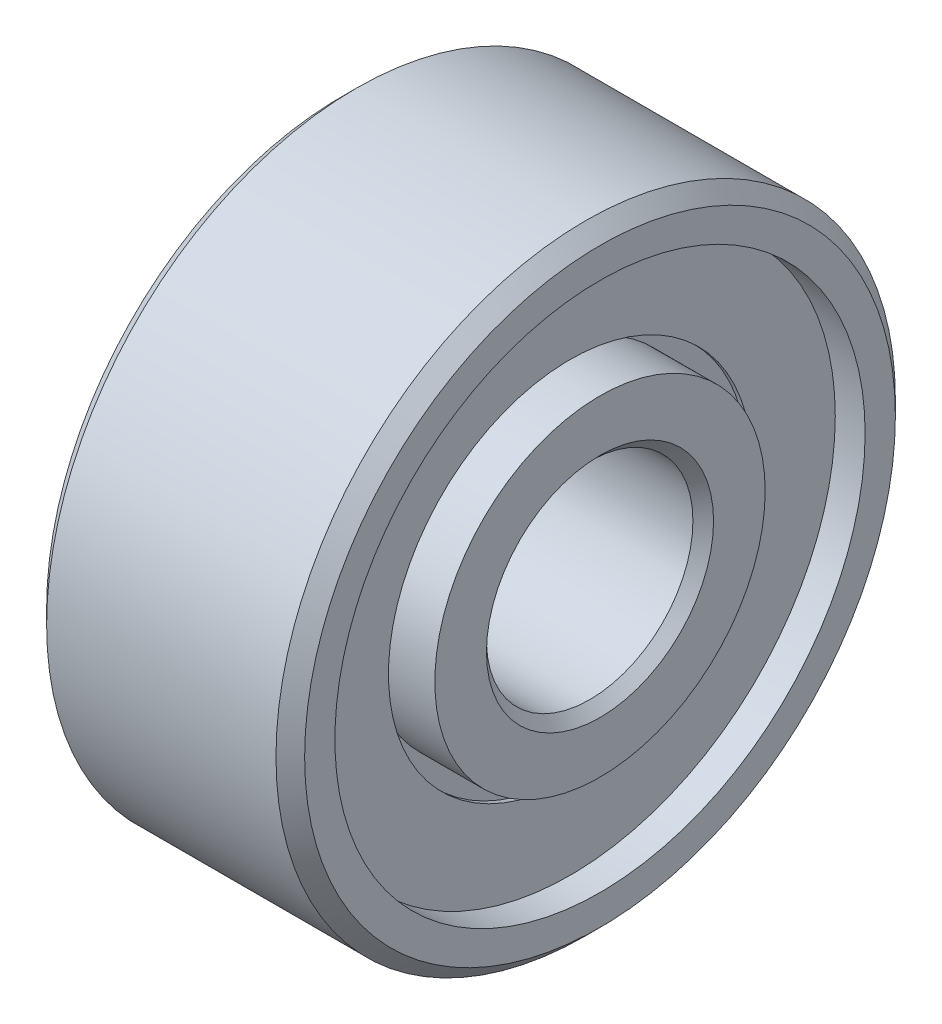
ISO-10303-21;
HEADER;
FILE_DESCRIPTION(('STEP AP214'),'2;1');
FILE_NAME('part.step','',(''),(''),'','','');
FILE_SCHEMA(('AUTOMOTIVE_DESIGN { 1 0 10303 214 1 1 1 1 }'));
ENDSEC;
DATA;
#1=APPLICATION_CONTEXT('core data for automotive mechanical design processes');
#2=APPLICATION_PROTOCOL_DEFINITION('international standard','automotive_design',2000,#1);
#3=PRODUCT_CONTEXT('',#1,'mechanical');
#4=PRODUCT('Part','Part','',(#3));
#5=PRODUCT_RELATED_PRODUCT_CATEGORY('part','',(#4));
#6=PRODUCT_DEFINITION_FORMATION('','',#4);
#7=PRODUCT_DEFINITION_CONTEXT('part definition',#1,'design');
#8=PRODUCT_DEFINITION('design','',#6,#7);
#9=PRODUCT_DEFINITION_SHAPE('','',#8);
#10=(LENGTH_UNIT() NAMED_UNIT(*) SI_UNIT(.MILLI.,.METRE.));
#11=(NAMED_UNIT(*) PLANE_ANGLE_UNIT() SI_UNIT($,.RADIAN.));
#12=(NAMED_UNIT(*) SI_UNIT($,.STERADIAN.) SOLID_ANGLE_UNIT());
#13=UNCERTAINTY_MEASURE_WITH_UNIT(LENGTH_MEASURE(1.E-05),#10,'distance_accuracy_value','');
#14=(GEOMETRIC_REPRESENTATION_CONTEXT(3) GLOBAL_UNCERTAINTY_ASSIGNED_CONTEXT((#13)) GLOBAL_UNIT_ASSIGNED_CONTEXT((#10,
#11,#12)) REPRESENTATION_CONTEXT('',''));
#15=CARTESIAN_POINT('',(0.,0.,0.));
#16=DIRECTION('',(0.,0.,1.));
#17=DIRECTION('',(1.,0.,0.));
#18=AXIS2_PLACEMENT_3D('',#15,#16,#17);
#19=CARTESIAN_POINT('',(-2.182114,0.,0.));
#20=DIRECTION('',(1.,0.,0.));
#21=DIRECTION('',(0.,0.,-1.));
#22=AXIS2_PLACEMENT_3D('',#19,#20,#21);
#23=CYLINDRICAL_SURFACE('',#22,1.5875);
#24=CARTESIAN_POINT('',(1.82504080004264,0.,0.));
#25=DIRECTION('',(1.,0.,0.));
#26=DIRECTION('',(0.,-1.,0.));
#27=AXIS2_PLACEMENT_3D('',#24,#25,#26);
#28=CIRCLE('',#27,1.58750000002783);
#29=CARTESIAN_POINT('',(1.82504080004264,-1.58750000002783,0.));
#30=VERTEX_POINT('',#29);
#31=EDGE_CURVE('E32',#30,#30,#28,.T.);
#32=ORIENTED_EDGE('',*,*,#31,.T.);
#33=EDGE_LOOP('',(#32));
#34=FACE_BOUND('',#33,.T.);
#35=CARTESIAN_POINT('',(-1.82504080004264,0.,0.));
#36=DIRECTION('',(-1.,0.,0.));
#37=DIRECTION('',(0.,1.,0.));
#38=AXIS2_PLACEMENT_3D('',#35,#36,#37);
#39=CIRCLE('',#38,1.58750000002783);
#40=CARTESIAN_POINT('',(-1.82504080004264,1.58750000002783,0.));
#41=VERTEX_POINT('',#40);
#42=EDGE_CURVE('E29',#41,#41,#39,.T.);
#43=ORIENTED_EDGE('',*,*,#42,.T.);
#44=EDGE_LOOP('',(#43));
#45=FACE_BOUND('',#44,.T.);
#46=ADVANCED_FACE('F14',(#34,#45),#23,.F.);
#47=CARTESIAN_POINT('',(1.98373999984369,0.,0.));
#48=DIRECTION('',(1.,0.,0.));
#49=DIRECTION('',(0.,0.,-1.));
#50=AXIS2_PLACEMENT_3D('',#47,#48,#49);
#51=CONICAL_SURFACE('',#50,1.74619919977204,0.785398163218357);
#52=CARTESIAN_POINT('',(1.98373999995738,0.,0.));
#53=DIRECTION('',(1.,0.,0.));
#54=DIRECTION('',(0.,0.,-1.));
#55=AXIS2_PLACEMENT_3D('',#52,#53,#54);
#56=CIRCLE('',#55,1.74619919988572);
#57=CARTESIAN_POINT('',(1.98373999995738,0.,-1.74619919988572));
#58=VERTEX_POINT('',#57);
#59=EDGE_CURVE('E17',#58,#58,#56,.F.);
#60=ORIENTED_EDGE('',*,*,#59,.F.);
#61=EDGE_LOOP('',(#60));
#62=FACE_BOUND('',#61,.T.);
#63=ORIENTED_EDGE('',*,*,#31,.F.);
#64=EDGE_LOOP('',(#63));
#65=FACE_BOUND('',#64,.T.);
#66=ADVANCED_FACE('F97',(#62,#65),#51,.F.);
#67=CARTESIAN_POINT('',(-1.98373999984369,0.,0.));
#68=DIRECTION('',(-1.,0.,0.));
#69=DIRECTION('',(0.,0.,1.));
#70=AXIS2_PLACEMENT_3D('',#67,#68,#69);
#71=CONICAL_SURFACE('',#70,1.74619919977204,0.785398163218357);
#72=ORIENTED_EDGE('',*,*,#42,.F.);
#73=EDGE_LOOP('',(#72));
#74=FACE_BOUND('',#73,.T.);
#75=CARTESIAN_POINT('',(-1.98373999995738,0.,0.));
#76=DIRECTION('',(-1.,0.,0.));
#77=DIRECTION('',(0.,0.,1.));
#78=AXIS2_PLACEMENT_3D('',#75,#76,#77);
#79=CIRCLE('',#78,1.74619919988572);
#80=CARTESIAN_POINT('',(-1.98373999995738,0.,1.74619919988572));
#81=VERTEX_POINT('',#80);
#82=EDGE_CURVE('E87',#81,#81,#79,.T.);
#83=ORIENTED_EDGE('',*,*,#82,.T.);
#84=EDGE_LOOP('',(#83));
#85=FACE_BOUND('',#84,.T.);
#86=ADVANCED_FACE('F100',(#74,#85),#71,.F.);
#87=CARTESIAN_POINT('',(1.98374,0.,0.));
#88=DIRECTION('',(1.,0.,0.));
#89=DIRECTION('',(0.,0.,-1.));
#90=AXIS2_PLACEMENT_3D('',#87,#88,#89);
#91=PLANE('',#90);
#92=ORIENTED_EDGE('',*,*,#59,.T.);
#93=EDGE_LOOP('',(#92));
#94=FACE_BOUND('',#93,.T.);
#95=CARTESIAN_POINT('',(1.98374,0.,0.));
#96=DIRECTION('',(1.,0.,0.));
#97=DIRECTION('',(0.,0.,-1.));
#98=AXIS2_PLACEMENT_3D('',#95,#96,#97);
#99=CIRCLE('',#98,2.54);
#100=CARTESIAN_POINT('',(1.98374,0.,-2.54));
#101=VERTEX_POINT('',#100);
#102=EDGE_CURVE('E85',#101,#101,#99,.F.);
#103=ORIENTED_EDGE('',*,*,#102,.F.);
#104=EDGE_LOOP('',(#103));
#105=FACE_BOUND('',#104,.T.);
#106=ADVANCED_FACE('F94',(#94,#105),#91,.T.);
#107=CARTESIAN_POINT('',(-1.98374,0.,0.));
#108=DIRECTION('',(1.,0.,0.));
#109=DIRECTION('',(0.,0.,-1.));
#110=AXIS2_PLACEMENT_3D('',#107,#108,#109);
#111=PLANE('',#110);
#112=ORIENTED_EDGE('',*,*,#82,.F.);
#113=EDGE_LOOP('',(#112));
#114=FACE_BOUND('',#113,.T.);
#115=CARTESIAN_POINT('',(-1.98374,0.,0.));
#116=DIRECTION('',(1.,0.,0.));
#117=DIRECTION('',(0.,0.,-1.));
#118=AXIS2_PLACEMENT_3D('',#115,#116,#117);
#119=CIRCLE('',#118,2.54);
#120=CARTESIAN_POINT('',(-1.98374,0.,-2.54));
#121=VERTEX_POINT('',#120);
#122=EDGE_CURVE('E82',#121,#121,#119,.T.);
#123=ORIENTED_EDGE('',*,*,#122,.F.);
#124=EDGE_LOOP('',(#123));
#125=FACE_BOUND('',#124,.T.);
#126=ADVANCED_FACE('F113',(#114,#125),#111,.F.);
#127=CARTESIAN_POINT('',(-2.182114,0.,0.));
#128=DIRECTION('',(1.,0.,0.));
#129=DIRECTION('',(0.,0.,-1.));
#130=AXIS2_PLACEMENT_3D('',#127,#128,#129);
#131=CYLINDRICAL_SURFACE('',#130,2.54);
#132=CARTESIAN_POINT('',(0.99187,0.,0.));
#133=DIRECTION('',(1.,0.,0.));
#134=DIRECTION('',(0.,0.,-1.));
#135=AXIS2_PLACEMENT_3D('',#132,#133,#134);
#136=CIRCLE('',#135,2.54);
#137=CARTESIAN_POINT('',(0.99187,0.,-2.54));
#138=VERTEX_POINT('',#137);
#139=EDGE_CURVE('E79',#138,#138,#136,.F.);
#140=ORIENTED_EDGE('',*,*,#139,.F.);
#141=EDGE_LOOP('',(#140));
#142=FACE_BOUND('',#141,.T.);
#143=ORIENTED_EDGE('',*,*,#102,.T.);
#144=EDGE_LOOP('',(#143));
#145=FACE_BOUND('',#144,.T.);
#146=ADVANCED_FACE('F189',(#142,#145),#131,.T.);
#147=CARTESIAN_POINT('',(-2.182114,0.,0.));
#148=DIRECTION('',(1.,0.,0.));
#149=DIRECTION('',(0.,0.,-1.));
#150=AXIS2_PLACEMENT_3D('',#147,#148,#149);
#151=CYLINDRICAL_SURFACE('',#150,2.54);
#152=ORIENTED_EDGE('',*,*,#122,.T.);
#153=EDGE_LOOP('',(#152));
#154=FACE_BOUND('',#153,.T.);
#155=CARTESIAN_POINT('',(-0.99187,0.,0.));
#156=DIRECTION('',(1.,0.,0.));
#157=DIRECTION('',(0.,0.,-1.));
#158=AXIS2_PLACEMENT_3D('',#155,#156,#157);
#159=CIRCLE('',#158,2.54);
#160=CARTESIAN_POINT('',(-0.99187,0.,-2.54));
#161=VERTEX_POINT('',#160);
#162=EDGE_CURVE('E76',#161,#161,#159,.F.);
#163=ORIENTED_EDGE('',*,*,#162,.T.);
#164=EDGE_LOOP('',(#163));
#165=FACE_BOUND('',#164,.T.);
#166=ADVANCED_FACE('F185',(#154,#165),#151,.T.);
#167=CARTESIAN_POINT('',(0.99187,0.,0.));
#168=DIRECTION('',(1.,0.,0.));
#169=DIRECTION('',(0.,0.,-1.));
#170=AXIS2_PLACEMENT_3D('',#167,#168,#169);
#171=PLANE('',#170);
#172=ORIENTED_EDGE('',*,*,#139,.T.);
#173=EDGE_LOOP('',(#172));
#174=FACE_BOUND('',#173,.T.);
#175=CARTESIAN_POINT('',(0.99187,0.,0.));
#176=DIRECTION('',(1.,0.,0.));
#177=DIRECTION('',(0.,0.,-1.));
#178=AXIS2_PLACEMENT_3D('',#175,#176,#177);
#179=CIRCLE('',#178,4.0767);
#180=CARTESIAN_POINT('',(0.99187,0.,-4.0767));
#181=VERTEX_POINT('',#180);
#182=EDGE_CURVE('E73',#181,#181,#179,.T.);
#183=ORIENTED_EDGE('',*,*,#182,.T.);
#184=EDGE_LOOP('',(#183));
#185=FACE_BOUND('',#184,.T.);
#186=ADVANCED_FACE('F181',(#174,#185),#171,.T.);
#187=CARTESIAN_POINT('',(-0.99187,0.,0.));
#188=DIRECTION('',(1.,0.,0.));
#189=DIRECTION('',(0.,0.,-1.));
#190=AXIS2_PLACEMENT_3D('',#187,#188,#189);
#191=PLANE('',#190);
#192=ORIENTED_EDGE('',*,*,#162,.F.);
#193=EDGE_LOOP('',(#192));
#194=FACE_BOUND('',#193,.T.);
#195=CARTESIAN_POINT('',(-0.99187,0.,0.));
#196=DIRECTION('',(1.,0.,0.));
#197=DIRECTION('',(0.,0.,-1.));
#198=AXIS2_PLACEMENT_3D('',#195,#196,#197);
#199=CIRCLE('',#198,4.0767);
#200=CARTESIAN_POINT('',(-0.99187,0.,-4.0767));
#201=VERTEX_POINT('',#200);
#202=EDGE_CURVE('E70',#201,#201,#199,.F.);
#203=ORIENTED_EDGE('',*,*,#202,.T.);
#204=EDGE_LOOP('',(#203));
#205=FACE_BOUND('',#204,.T.);
#206=ADVANCED_FACE('F177',(#194,#205),#191,.F.);
#207=CARTESIAN_POINT('',(-2.182114,0.,0.));
#208=DIRECTION('',(1.,0.,0.));
#209=DIRECTION('',(0.,0.,-1.));
#210=AXIS2_PLACEMENT_3D('',#207,#208,#209);
#211=CYLINDRICAL_SURFACE('',#210,4.0767);
#212=ORIENTED_EDGE('',*,*,#182,.F.);
#213=EDGE_LOOP('',(#212));
#214=FACE_BOUND('',#213,.T.);
#215=CARTESIAN_POINT('',(1.450609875,0.,0.));
#216=DIRECTION('',(1.,0.,0.));
#217=DIRECTION('',(0.,0.,-1.));
#218=AXIS2_PLACEMENT_3D('',#215,#216,#217);
#219=CIRCLE('',#218,4.0767);
#220=CARTESIAN_POINT('',(1.450609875,0.,-4.0767));
#221=VERTEX_POINT('',#220);
#222=EDGE_CURVE('E67',#221,#221,#219,.T.);
#223=ORIENTED_EDGE('',*,*,#222,.T.);
#224=EDGE_LOOP('',(#223));
#225=FACE_BOUND('',#224,.T.);
#226=ADVANCED_FACE('F173',(#214,#225),#211,.F.);
#227=CARTESIAN_POINT('',(-2.182114,0.,0.));
#228=DIRECTION('',(1.,0.,0.));
#229=DIRECTION('',(0.,0.,-1.));
#230=AXIS2_PLACEMENT_3D('',#227,#228,#229);
#231=CYLINDRICAL_SURFACE('',#230,4.0767);
#232=ORIENTED_EDGE('',*,*,#202,.F.);
#233=EDGE_LOOP('',(#232));
#234=FACE_BOUND('',#233,.T.);
#235=CARTESIAN_POINT('',(-1.450609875,0.,0.));
#236=DIRECTION('',(1.,0.,0.));
#237=DIRECTION('',(0.,0.,-1.));
#238=AXIS2_PLACEMENT_3D('',#235,#236,#237);
#239=CIRCLE('',#238,4.0767);
#240=CARTESIAN_POINT('',(-1.450609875,0.,-4.0767));
#241=VERTEX_POINT('',#240);
#242=EDGE_CURVE('E64',#241,#241,#239,.T.);
#243=ORIENTED_EDGE('',*,*,#242,.F.);
#244=EDGE_LOOP('',(#243));
#245=FACE_BOUND('',#244,.T.);
#246=ADVANCED_FACE('F169',(#234,#245),#231,.F.);
#247=CARTESIAN_POINT('',(1.450609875,0.,0.));
#248=DIRECTION('',(1.,0.,0.));
#249=DIRECTION('',(0.,0.,-1.));
#250=AXIS2_PLACEMENT_3D('',#247,#248,#249);
#251=PLANE('',#250);
#252=CARTESIAN_POINT('',(1.450609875,0.,0.));
#253=DIRECTION('',(1.,0.,0.));
#254=DIRECTION('',(0.,0.,-1.));
#255=AXIS2_PLACEMENT_3D('',#252,#253,#254);
#256=CIRCLE('',#255,2.794);
#257=CARTESIAN_POINT('',(1.450609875,0.,-2.794));
#258=VERTEX_POINT('',#257);
#259=EDGE_CURVE('E61',#258,#258,#256,.T.);
#260=ORIENTED_EDGE('',*,*,#259,.T.);
#261=EDGE_LOOP('',(#260));
#262=FACE_BOUND('',#261,.T.);
#263=ORIENTED_EDGE('',*,*,#222,.F.);
#264=EDGE_LOOP('',(#263));
#265=FACE_BOUND('',#264,.T.);
#266=ADVANCED_FACE('F165',(#262,#265),#251,.F.);
#267=CARTESIAN_POINT('',(-1.450609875,0.,0.));
#268=DIRECTION('',(1.,0.,0.));
#269=DIRECTION('',(0.,0.,-1.));
#270=AXIS2_PLACEMENT_3D('',#267,#268,#269);
#271=PLANE('',#270);
#272=CARTESIAN_POINT('',(-1.450609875,0.,0.));
#273=DIRECTION('',(1.,0.,0.));
#274=DIRECTION('',(0.,0.,-1.));
#275=AXIS2_PLACEMENT_3D('',#272,#273,#274);
#276=CIRCLE('',#275,2.794);
#277=CARTESIAN_POINT('',(-1.450609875,0.,-2.794));
#278=VERTEX_POINT('',#277);
#279=EDGE_CURVE('E58',#278,#278,#276,.F.);
#280=ORIENTED_EDGE('',*,*,#279,.T.);
#281=EDGE_LOOP('',(#280));
#282=FACE_BOUND('',#281,.T.);
#283=ORIENTED_EDGE('',*,*,#242,.T.);
#284=EDGE_LOOP('',(#283));
#285=FACE_BOUND('',#284,.T.);
#286=ADVANCED_FACE('F161',(#282,#285),#271,.T.);
#287=CARTESIAN_POINT('',(1.4468903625,0.,0.));
#288=DIRECTION('',(1.,0.,0.));
#289=DIRECTION('',(0.,0.,-1.));
#290=AXIS2_PLACEMENT_3D('',#287,#288,#289);
#291=CYLINDRICAL_SURFACE('',#290,2.794);
#292=CARTESIAN_POINT('',(1.525000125,0.,0.));
#293=DIRECTION('',(1.,0.,0.));
#294=DIRECTION('',(0.,0.,-1.));
#295=AXIS2_PLACEMENT_3D('',#292,#293,#294);
#296=CIRCLE('',#295,2.794);
#297=CARTESIAN_POINT('',(1.525000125,0.,-2.794));
#298=VERTEX_POINT('',#297);
#299=EDGE_CURVE('E55',#298,#298,#296,.F.);
#300=ORIENTED_EDGE('',*,*,#299,.F.);
#301=EDGE_LOOP('',(#300));
#302=FACE_BOUND('',#301,.T.);
#303=ORIENTED_EDGE('',*,*,#259,.F.);
#304=EDGE_LOOP('',(#303));
#305=FACE_BOUND('',#304,.T.);
#306=ADVANCED_FACE('F157',(#302,#305),#291,.F.);
#307=CARTESIAN_POINT('',(-1.4468903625,0.,0.));
#308=DIRECTION('',(1.,0.,0.));
#309=DIRECTION('',(0.,0.,-1.));
#310=AXIS2_PLACEMENT_3D('',#307,#308,#309);
#311=CYLINDRICAL_SURFACE('',#310,2.794);
#312=CARTESIAN_POINT('',(-1.525000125,0.,0.));
#313=DIRECTION('',(1.,0.,0.));
#314=DIRECTION('',(0.,0.,-1.));
#315=AXIS2_PLACEMENT_3D('',#312,#313,#314);
#316=CIRCLE('',#315,2.794);
#317=CARTESIAN_POINT('',(-1.525000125,0.,-2.794));
#318=VERTEX_POINT('',#317);
#319=EDGE_CURVE('E52',#318,#318,#316,.F.);
#320=ORIENTED_EDGE('',*,*,#319,.T.);
#321=EDGE_LOOP('',(#320));
#322=FACE_BOUND('',#321,.T.);
#323=ORIENTED_EDGE('',*,*,#279,.F.);
#324=EDGE_LOOP('',(#323));
#325=FACE_BOUND('',#324,.T.);
#326=ADVANCED_FACE('F153',(#322,#325),#311,.F.);
#327=CARTESIAN_POINT('',(1.525000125,0.,0.));
#328=DIRECTION('',(1.,0.,0.));
#329=DIRECTION('',(0.,0.,-1.));
#330=AXIS2_PLACEMENT_3D('',#327,#328,#329);
#331=PLANE('',#330);
#332=ORIENTED_EDGE('',*,*,#299,.T.);
#333=EDGE_LOOP('',(#332));
#334=FACE_BOUND('',#333,.T.);
#335=CARTESIAN_POINT('',(1.525000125,0.,0.));
#336=DIRECTION('',(1.,0.,0.));
#337=DIRECTION('',(0.,0.,-1.));
#338=AXIS2_PLACEMENT_3D('',#335,#336,#337);
#339=CIRCLE('',#338,4.0767);
#340=CARTESIAN_POINT('',(1.525000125,0.,-4.0767));
#341=VERTEX_POINT('',#340);
#342=EDGE_CURVE('E49',#341,#341,#339,.T.);
#343=ORIENTED_EDGE('',*,*,#342,.T.);
#344=EDGE_LOOP('',(#343));
#345=FACE_BOUND('',#344,.T.);
#346=ADVANCED_FACE('F149',(#334,#345),#331,.T.);
#347=CARTESIAN_POINT('',(-1.525000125,0.,0.));
#348=DIRECTION('',(1.,0.,0.));
#349=DIRECTION('',(0.,0.,-1.));
#350=AXIS2_PLACEMENT_3D('',#347,#348,#349);
#351=PLANE('',#350);
#352=ORIENTED_EDGE('',*,*,#319,.F.);
#353=EDGE_LOOP('',(#352));
#354=FACE_BOUND('',#353,.T.);
#355=CARTESIAN_POINT('',(-1.525000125,0.,0.));
#356=DIRECTION('',(1.,0.,0.));
#357=DIRECTION('',(0.,0.,-1.));
#358=AXIS2_PLACEMENT_3D('',#355,#356,#357);
#359=CIRCLE('',#358,4.0767);
#360=CARTESIAN_POINT('',(-1.525000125,0.,-4.0767));
#361=VERTEX_POINT('',#360);
#362=EDGE_CURVE('E46',#361,#361,#359,.F.);
#363=ORIENTED_EDGE('',*,*,#362,.T.);
#364=EDGE_LOOP('',(#363));
#365=FACE_BOUND('',#364,.T.);
#366=ADVANCED_FACE('F145',(#354,#365),#351,.F.);
#367=CARTESIAN_POINT('',(-2.182114,0.,0.));
#368=DIRECTION('',(1.,0.,0.));
#369=DIRECTION('',(0.,0.,-1.));
#370=AXIS2_PLACEMENT_3D('',#367,#368,#369);
#371=CYLINDRICAL_SURFACE('',#370,4.0767);
#372=CARTESIAN_POINT('',(1.98374,0.,0.));
#373=DIRECTION('',(1.,0.,0.));
#374=DIRECTION('',(0.,0.,-1.));
#375=AXIS2_PLACEMENT_3D('',#372,#373,#374);
#376=CIRCLE('',#375,4.0767);
#377=CARTESIAN_POINT('',(1.98374,0.,-4.0767));
#378=VERTEX_POINT('',#377);
#379=EDGE_CURVE('E43',#378,#378,#376,.F.);
#380=ORIENTED_EDGE('',*,*,#379,.F.);
#381=EDGE_LOOP('',(#380));
#382=FACE_BOUND('',#381,.T.);
#383=ORIENTED_EDGE('',*,*,#342,.F.);
#384=EDGE_LOOP('',(#383));
#385=FACE_BOUND('',#384,.T.);
#386=ADVANCED_FACE('F141',(#382,#385),#371,.F.);
#387=CARTESIAN_POINT('',(-2.182114,0.,0.));
#388=DIRECTION('',(1.,0.,0.));
#389=DIRECTION('',(0.,0.,-1.));
#390=AXIS2_PLACEMENT_3D('',#387,#388,#389);
#391=CYLINDRICAL_SURFACE('',#390,4.0767);
#392=CARTESIAN_POINT('',(-1.98374,0.,0.));
#393=DIRECTION('',(1.,0.,0.));
#394=DIRECTION('',(0.,0.,-1.));
#395=AXIS2_PLACEMENT_3D('',#392,#393,#394);
#396=CIRCLE('',#395,4.0767);
#397=CARTESIAN_POINT('',(-1.98374,0.,-4.0767));
#398=VERTEX_POINT('',#397);
#399=EDGE_CURVE('E40',#398,#398,#396,.F.);
#400=ORIENTED_EDGE('',*,*,#399,.T.);
#401=EDGE_LOOP('',(#400));
#402=FACE_BOUND('',#401,.T.);
#403=ORIENTED_EDGE('',*,*,#362,.F.);
#404=EDGE_LOOP('',(#403));
#405=FACE_BOUND('',#404,.T.);
#406=ADVANCED_FACE('F137',(#402,#405),#391,.F.);
#407=CARTESIAN_POINT('',(1.98374,0.,0.));
#408=DIRECTION('',(1.,0.,0.));
#409=DIRECTION('',(0.,0.,-1.));
#410=AXIS2_PLACEMENT_3D('',#407,#408,#409);
#411=PLANE('',#410);
#412=ORIENTED_EDGE('',*,*,#379,.T.);
#413=EDGE_LOOP('',(#412));
#414=FACE_BOUND('',#413,.T.);
#415=CARTESIAN_POINT('',(1.98374000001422,0.,0.));
#416=DIRECTION('',(-1.,0.,0.));
#417=DIRECTION('',(0.,0.,1.));
#418=AXIS2_PLACEMENT_3D('',#415,#416,#417);
#419=CIRCLE('',#418,4.54208444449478);
#420=CARTESIAN_POINT('',(1.98374000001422,0.,4.54208444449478));
#421=VERTEX_POINT('',#420);
#422=EDGE_CURVE('E37',#421,#421,#419,.T.);
#423=ORIENTED_EDGE('',*,*,#422,.F.);
#424=EDGE_LOOP('',(#423));
#425=FACE_BOUND('',#424,.T.);
#426=ADVANCED_FACE('F133',(#414,#425),#411,.T.);
#427=CARTESIAN_POINT('',(-1.98374,0.,0.));
#428=DIRECTION('',(1.,0.,0.));
#429=DIRECTION('',(0.,0.,-1.));
#430=AXIS2_PLACEMENT_3D('',#427,#428,#429);
#431=PLANE('',#430);
#432=ORIENTED_EDGE('',*,*,#399,.F.);
#433=EDGE_LOOP('',(#432));
#434=FACE_BOUND('',#433,.T.);
#435=CARTESIAN_POINT('',(-1.98374000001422,0.,0.));
#436=DIRECTION('',(1.,0.,0.));
#437=DIRECTION('',(0.,0.,-1.));
#438=AXIS2_PLACEMENT_3D('',#435,#436,#437);
#439=CIRCLE('',#438,4.54208444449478);
#440=CARTESIAN_POINT('',(-1.98374000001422,0.,-4.54208444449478));
#441=VERTEX_POINT('',#440);
#442=EDGE_CURVE('E26',#441,#441,#439,.T.);
#443=ORIENTED_EDGE('',*,*,#442,.F.);
#444=EDGE_LOOP('',(#443));
#445=FACE_BOUND('',#444,.T.);
#446=ADVANCED_FACE('F129',(#434,#445),#431,.F.);
#447=CARTESIAN_POINT('',(1.76332444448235,0.,0.));
#448=DIRECTION('',(-1.,0.,0.));
#449=DIRECTION('',(0.,0.,1.));
#450=AXIS2_PLACEMENT_3D('',#447,#448,#449);
#451=CONICAL_SURFACE('',#450,4.76250000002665,0.785398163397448);
#452=CARTESIAN_POINT('',(1.76332444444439,0.,0.));
#453=DIRECTION('',(1.,0.,0.));
#454=DIRECTION('',(0.,0.,-1.));
#455=AXIS2_PLACEMENT_3D('',#452,#453,#454);
#456=CIRCLE('',#455,4.7625);
#457=CARTESIAN_POINT('',(1.76332444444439,0.,-4.7625));
#458=VERTEX_POINT('',#457);
#459=EDGE_CURVE('E21',#458,#458,#456,.F.);
#460=ORIENTED_EDGE('',*,*,#459,.F.);
#461=EDGE_LOOP('',(#460));
#462=FACE_BOUND('',#461,.T.);
#463=ORIENTED_EDGE('',*,*,#422,.T.);
#464=EDGE_LOOP('',(#463));
#465=FACE_BOUND('',#464,.T.);
#466=ADVANCED_FACE('F122',(#462,#465),#451,.T.);
#467=CARTESIAN_POINT('',(-1.76332444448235,0.,0.));
#468=DIRECTION('',(1.,0.,0.));
#469=DIRECTION('',(0.,0.,-1.));
#470=AXIS2_PLACEMENT_3D('',#467,#468,#469);
#471=CONICAL_SURFACE('',#470,4.76250000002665,0.785398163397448);
#472=ORIENTED_EDGE('',*,*,#442,.T.);
#473=EDGE_LOOP('',(#472));
#474=FACE_BOUND('',#473,.T.);
#475=CARTESIAN_POINT('',(-1.76332444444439,0.,0.));
#476=DIRECTION('',(1.,0.,0.));
#477=DIRECTION('',(0.,0.,-1.));
#478=AXIS2_PLACEMENT_3D('',#475,#476,#477);
#479=CIRCLE('',#478,4.7625);
#480=CARTESIAN_POINT('',(-1.76332444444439,0.,-4.7625));
#481=VERTEX_POINT('',#480);
#482=EDGE_CURVE('E10',#481,#481,#479,.T.);
#483=ORIENTED_EDGE('',*,*,#482,.F.);
#484=EDGE_LOOP('',(#483));
#485=FACE_BOUND('',#484,.T.);
#486=ADVANCED_FACE('F117',(#474,#485),#471,.T.);
#487=CARTESIAN_POINT('',(-2.182114,0.,0.));
#488=DIRECTION('',(1.,0.,0.));
#489=DIRECTION('',(0.,0.,-1.));
#490=AXIS2_PLACEMENT_3D('',#487,#488,#489);
#491=CYLINDRICAL_SURFACE('',#490,4.7625);
#492=ORIENTED_EDGE('',*,*,#482,.T.);
#493=EDGE_LOOP('',(#492));
#494=FACE_BOUND('',#493,.T.);
#495=ORIENTED_EDGE('',*,*,#459,.T.);
#496=EDGE_LOOP('',(#495));
#497=FACE_BOUND('',#496,.T.);
#498=ADVANCED_FACE('F115',(#494,#497),#491,.T.);
#499=CLOSED_SHELL('',(#46,#66,#86,#106,#126,#146,#166,#186,#206,#226,#246,#266,#286,#306,#326,
#346,#366,#386,#406,#426,#446,#466,#486,#498));
#500=MANIFOLD_SOLID_BREP('B1',#499);
#501=ADVANCED_BREP_SHAPE_REPRESENTATION('',(#18,#500),#14);
#502=SHAPE_DEFINITION_REPRESENTATION(#9,#501);
ENDSEC;
END-ISO-10303-21;
